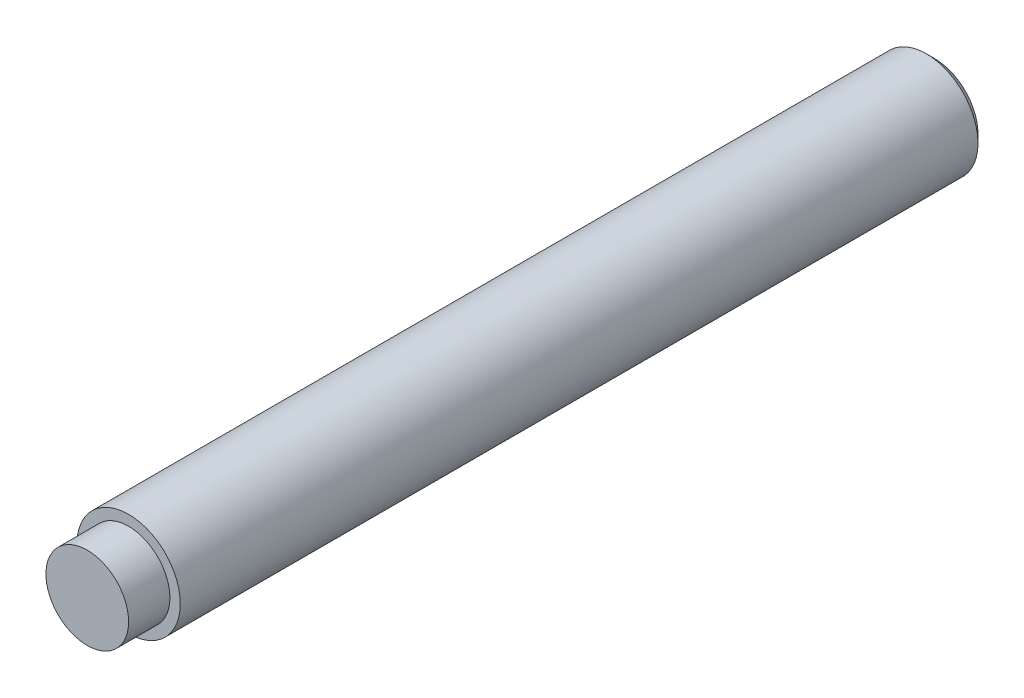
from build123d import *

# Parameters (mm, degrees)
ESQUISSE1_R          = 2.5
BASE_EXTRUSION_DEPTH = 39
CHANFREIN1_SIZE      = 0.4
ESQUISSE2_R          = 2
BOSS_EXTRU_1_DEPTH   = 2


with BuildPart() as part:
    # Esquisse1 → Base-Extrusion (new body)
    with BuildSketch(Plane.XY):
        Circle(ESQUISSE1_R)
    extrude(amount=BASE_EXTRUSION_DEPTH)

    # Chanfrein1
    chanfrein1_edges = [part.edges().sort_by_distance(p)[0] for p in [
        (-2.5, 0, 0),
    ]]
    chamfer(chanfrein1_edges, length=CHANFREIN1_SIZE)

    # Esquisse2 → Boss.-Extru.1 (add)
    with BuildSketch(Plane.XY.offset(39)):
        Circle(ESQUISSE2_R)
    extrude(amount=BOSS_EXTRU_1_DEPTH)


solid = part.part
